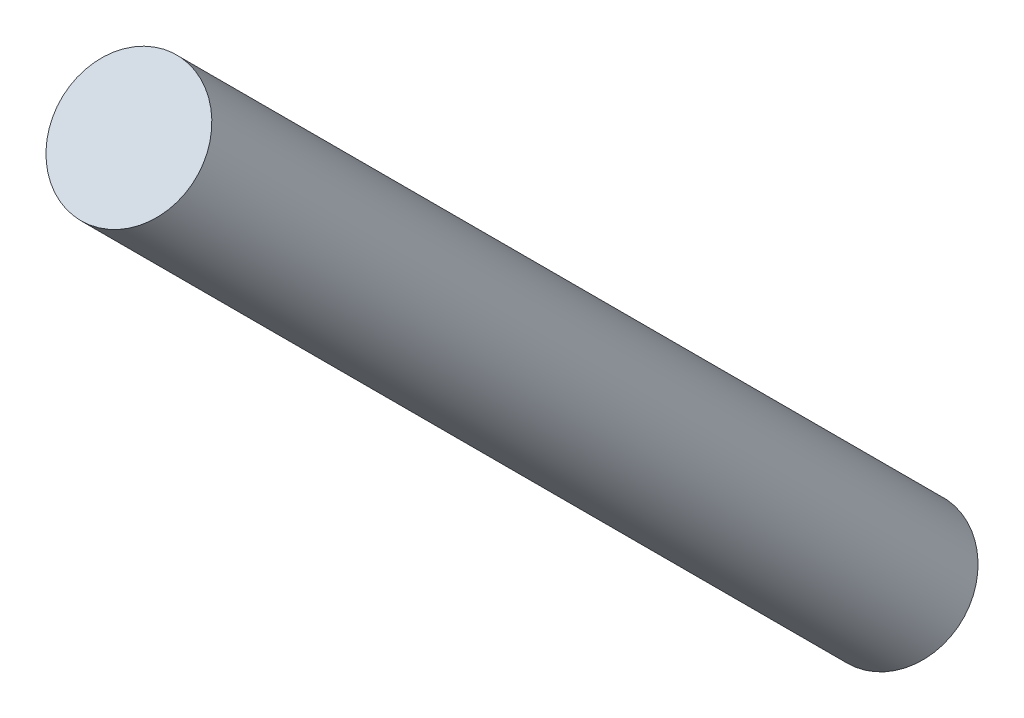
from build123d import *

# Parameters (mm, degrees)
SKETCH4_R = 6.35


with BuildPart() as part:
    # Sweep1: sweep along a path in Sketch2
    with BuildLine(Plane(origin=(0, 0, 0), x_dir=(0, 0, -1), z_dir=(1, 0, 0))) as sweep1_path:
        Line((0, 0), (-71.842048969, 71.842048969))
    # Sketch4 → Sweep1 (sweep)
    with BuildSketch(Plane(origin=(0, 0, 0), x_dir=(1, 0, 0), z_dir=(0, 0.7071067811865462, 0.7071067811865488))):
        Circle(SKETCH4_R)
    sweep(path=sweep1_path.line)


solid = part.part
